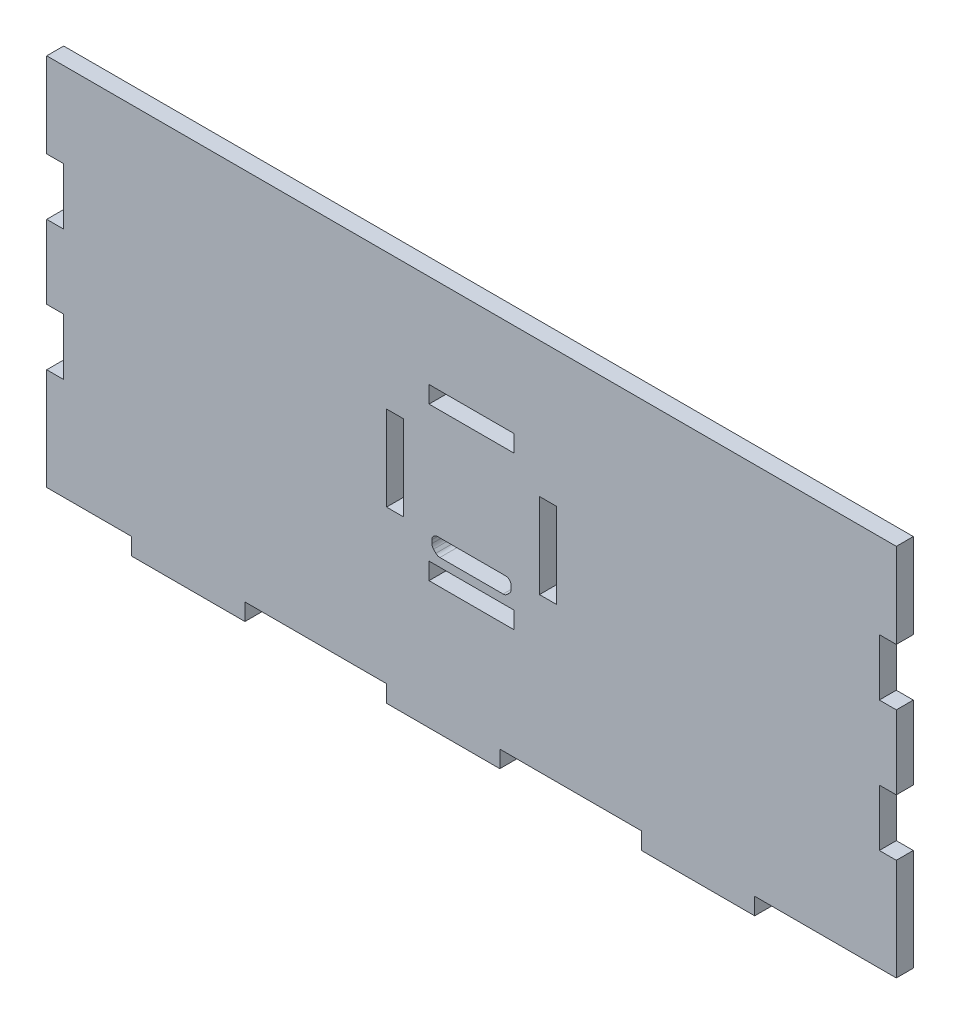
from build123d import *

# Parameters (mm, degrees)
CROQUIS1_W              = 150
CROQUIS1_H              = 75
SALIENTE_EXTRUIR1_DEPTH = 3
CROQUIS2_W              = 150
CROQUIS2_H              = 6
CROQUIS2_W_2            = 25
CROQUIS2_H_2            = 3
CROQUIS2_W_3            = 15
CROQUIS2_W_4            = 3
CROQUIS2_H_3            = 10
CROQUIS2_H_4            = 15
CORTAR_EXTRUIR1_DEPTH   = 6


with BuildPart() as part:
    # Croquis1 → Saliente-Extruir1 (new body)
    with BuildSketch(Plane.XY):
        with Locations((75, 37.5)):
            Rectangle(CROQUIS1_W, CROQUIS1_H)
    extrude(amount=SALIENTE_EXTRUIR1_DEPTH)

    # Croquis2 → Cortar-Extruir1 (cut)
    with BuildSketch(Plane.XY.offset(3)):
        with Locations((75, 72)):
            Rectangle(CROQUIS2_W, CROQUIS2_H)
        with Locations((137.5, 1.5)):
            Rectangle(CROQUIS2_W_2, CROQUIS2_H_2)
        with Locations((92.5, 1.5)):
            Rectangle(CROQUIS2_W_2, CROQUIS2_H_2)
        with Locations((47.5, 1.5)):
            Rectangle(CROQUIS2_W_2, CROQUIS2_H_2)
        with Locations((7.5, 1.5)):
            Rectangle(CROQUIS2_W_3, CROQUIS2_H_2)
        with Locations((148.5, 49)):
            Rectangle(CROQUIS2_W_4, CROQUIS2_H_3)
        with Locations((1.5, 26)):
            Rectangle(CROQUIS2_W_4, CROQUIS2_H_3)
        with Locations((1.5, 49)):
            Rectangle(CROQUIS2_W_4, CROQUIS2_H_3)
        with Locations((148.5, 26)):
            Rectangle(CROQUIS2_W_4, CROQUIS2_H_3)
        with Locations((75, 51)):
            Rectangle(CROQUIS2_W_3, CROQUIS2_H_2)
        with Locations((61.5, 37.5)):
            Rectangle(CROQUIS2_W_4, CROQUIS2_H_4)
        with Locations((75, 24)):
            Rectangle(CROQUIS2_W_3, CROQUIS2_H_2)
        Polygon((87, 45.121910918), (87, 30.121910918), (90, 30.121910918), (90, 37.621910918), (90, 45.121910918), align=None)
        with BuildLine():
            Line((68.292893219, 27.707106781), (68.707106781, 27.292893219))
            ThreePointArc((68.707106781, 27.292893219), (69.03153013, 27.076120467), (69.414213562, 27))
            Line((69.414213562, 27), (75, 27))
            Line((75, 27), (80.585786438, 27))
            ThreePointArc((80.585786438, 27), (80.96846987, 27.076120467), (81.292893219, 27.292893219))
            Line((81.292893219, 27.292893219), (81.707106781, 27.707106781))
            ThreePointArc((81.707106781, 27.707106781), (81.923879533, 28.03153013), (82, 28.414213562))
            Line((82, 28.414213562), (82, 29))
            ThreePointArc((82, 29), (81.707106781, 29.707106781), (81, 30))
            Line((81, 30), (69, 30))
            ThreePointArc((69, 30), (68.292893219, 29.707106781), (68, 29))
            Line((68, 29), (68, 28.414213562))
            ThreePointArc((68, 28.414213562), (68.076120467, 28.03153013), (68.292893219, 27.707106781))
        make_face()
    extrude(amount=-CORTAR_EXTRUIR1_DEPTH, mode=Mode.SUBTRACT)


solid = part.part
